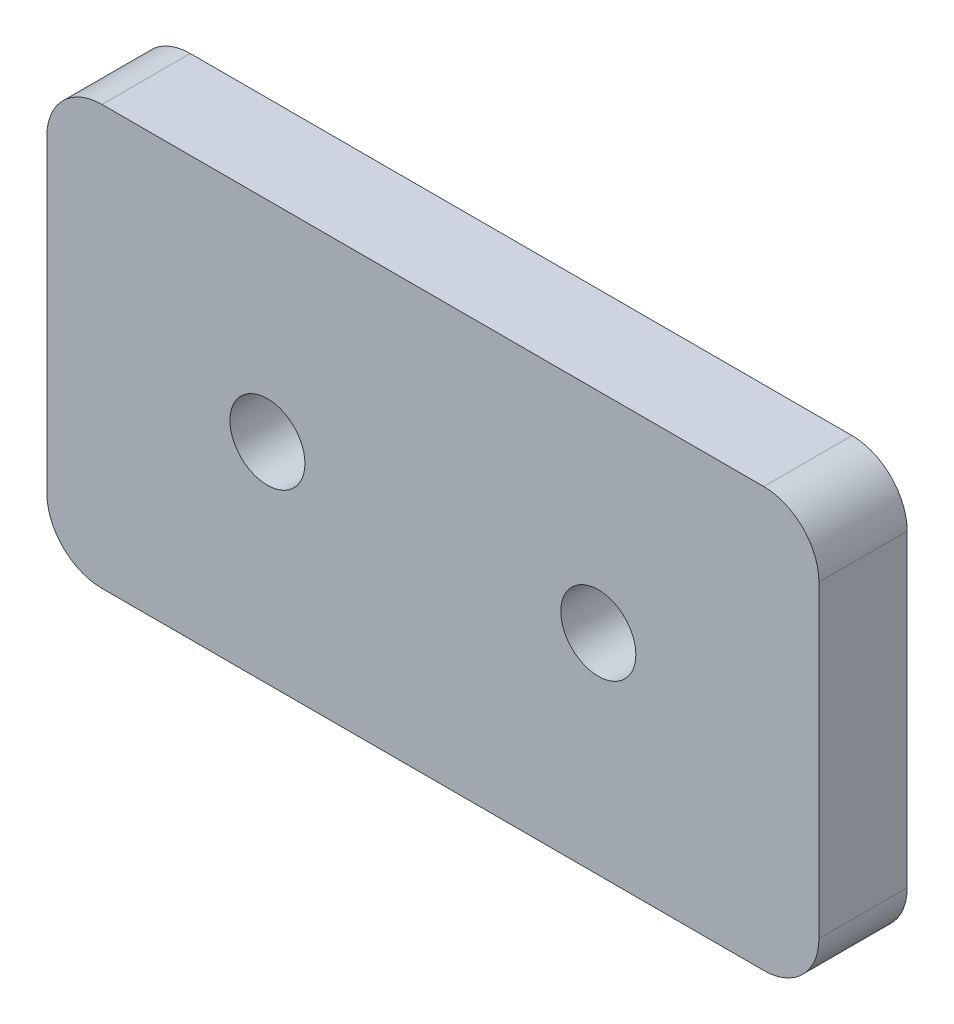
from build123d import *

# Parameters (mm, degrees)
ESQUISSE1_W      = 70
ESQUISSE1_H      = 38
ESQUISSE1_R      = 3.4
EXTRUSION1_DEPTH = 8
CONG_1_R         = 5


with BuildPart() as part:
    # Esquisse1 → Extrusion1 (new body)
    with BuildSketch(Plane.XY):
        with Locations((35, 19)):
            Rectangle(ESQUISSE1_W, ESQUISSE1_H)
        with Locations((20, 19)):
            Circle(ESQUISSE1_R, mode=Mode.SUBTRACT)
        with Locations((50, 19)):
            Circle(ESQUISSE1_R, mode=Mode.SUBTRACT)
    extrude(amount=EXTRUSION1_DEPTH)

    # Cong_1
    cong_1_edges = [part.edges().sort_by_distance(p)[0] for p in [
        (0, 38, 4),
        (70, 38, 4),
        (70, 0, 4),
        (0, 0, 4),
    ]]
    fillet(cong_1_edges, radius=CONG_1_R)


solid = part.part
